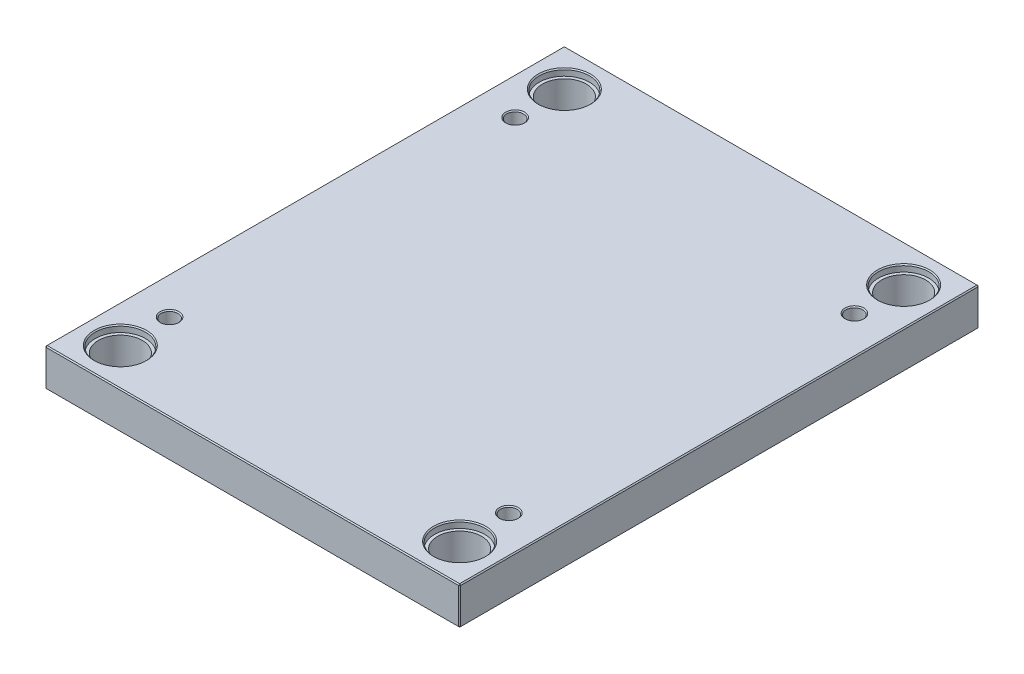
ISO-10303-21;
HEADER;
FILE_DESCRIPTION(('STEP AP214'),'2;1');
FILE_NAME('part.step','',(''),(''),'','','');
FILE_SCHEMA(('AUTOMOTIVE_DESIGN { 1 0 10303 214 1 1 1 1 }'));
ENDSEC;
DATA;
#1=APPLICATION_CONTEXT('core data for automotive mechanical design processes');
#2=APPLICATION_PROTOCOL_DEFINITION('international standard','automotive_design',2000,#1);
#3=PRODUCT_CONTEXT('',#1,'mechanical');
#4=PRODUCT('Part','Part','',(#3));
#5=PRODUCT_RELATED_PRODUCT_CATEGORY('part','',(#4));
#6=PRODUCT_DEFINITION_FORMATION('','',#4);
#7=PRODUCT_DEFINITION_CONTEXT('part definition',#1,'design');
#8=PRODUCT_DEFINITION('design','',#6,#7);
#9=PRODUCT_DEFINITION_SHAPE('','',#8);
#10=(LENGTH_UNIT() NAMED_UNIT(*) SI_UNIT(.MILLI.,.METRE.));
#11=(NAMED_UNIT(*) PLANE_ANGLE_UNIT() SI_UNIT($,.RADIAN.));
#12=(NAMED_UNIT(*) SI_UNIT($,.STERADIAN.) SOLID_ANGLE_UNIT());
#13=UNCERTAINTY_MEASURE_WITH_UNIT(LENGTH_MEASURE(1.E-05),#10,'distance_accuracy_value','');
#14=(GEOMETRIC_REPRESENTATION_CONTEXT(3) GLOBAL_UNCERTAINTY_ASSIGNED_CONTEXT((#13)) GLOBAL_UNIT_ASSIGNED_CONTEXT((#10,
#11,#12)) REPRESENTATION_CONTEXT('',''));
#15=CARTESIAN_POINT('',(0.,0.,0.));
#16=DIRECTION('',(0.,0.,1.));
#17=DIRECTION('',(1.,0.,0.));
#18=AXIS2_PLACEMENT_3D('',#15,#16,#17);
#19=CARTESIAN_POINT('',(-162.,0.,-212.));
#20=DIRECTION('',(0.,1.,0.));
#21=DIRECTION('',(0.,0.,1.));
#22=AXIS2_PLACEMENT_3D('',#19,#20,#21);
#23=CYLINDRICAL_SURFACE('',#22,21.);
#24=CARTESIAN_POINT('',(-162.,1.00000000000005,-212.));
#25=DIRECTION('',(0.,1.,0.));
#26=DIRECTION('',(0.,0.,1.));
#27=AXIS2_PLACEMENT_3D('',#24,#25,#26);
#28=CIRCLE('',#27,21.);
#29=CARTESIAN_POINT('',(-162.,1.00000000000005,-191.));
#30=VERTEX_POINT('',#29);
#31=EDGE_CURVE('E472',#30,#30,#28,.F.);
#32=ORIENTED_EDGE('',*,*,#31,.T.);
#33=EDGE_LOOP('',(#32));
#34=FACE_BOUND('',#33,.T.);
#35=CARTESIAN_POINT('',(-162.,29.7,-212.));
#36=DIRECTION('',(0.,1.,0.));
#37=DIRECTION('',(0.,0.,1.));
#38=AXIS2_PLACEMENT_3D('',#35,#36,#37);
#39=CIRCLE('',#38,21.);
#40=CARTESIAN_POINT('',(-162.,29.7,-191.));
#41=VERTEX_POINT('',#40);
#42=EDGE_CURVE('E221',#41,#41,#39,.F.);
#43=ORIENTED_EDGE('',*,*,#42,.F.);
#44=EDGE_LOOP('',(#43));
#45=FACE_BOUND('',#44,.T.);
#46=ADVANCED_FACE('F16',(#34,#45),#23,.F.);
#47=CARTESIAN_POINT('',(162.,0.,-212.));
#48=DIRECTION('',(0.,1.,0.));
#49=DIRECTION('',(0.,0.,1.));
#50=AXIS2_PLACEMENT_3D('',#47,#48,#49);
#51=CYLINDRICAL_SURFACE('',#50,21.);
#52=CARTESIAN_POINT('',(162.,1.00000000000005,-212.));
#53=DIRECTION('',(0.,1.,0.));
#54=DIRECTION('',(0.,0.,1.));
#55=AXIS2_PLACEMENT_3D('',#52,#53,#54);
#56=CIRCLE('',#55,21.);
#57=CARTESIAN_POINT('',(162.,1.00000000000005,-191.));
#58=VERTEX_POINT('',#57);
#59=EDGE_CURVE('E474',#58,#58,#56,.F.);
#60=ORIENTED_EDGE('',*,*,#59,.T.);
#61=EDGE_LOOP('',(#60));
#62=FACE_BOUND('',#61,.T.);
#63=CARTESIAN_POINT('',(162.,29.7,-212.));
#64=DIRECTION('',(0.,1.,0.));
#65=DIRECTION('',(0.,0.,1.));
#66=AXIS2_PLACEMENT_3D('',#63,#64,#65);
#67=CIRCLE('',#66,21.);
#68=CARTESIAN_POINT('',(162.,29.7,-191.));
#69=VERTEX_POINT('',#68);
#70=EDGE_CURVE('E218',#69,#69,#67,.F.);
#71=ORIENTED_EDGE('',*,*,#70,.F.);
#72=EDGE_LOOP('',(#71));
#73=FACE_BOUND('',#72,.T.);
#74=ADVANCED_FACE('F263',(#62,#73),#51,.F.);
#75=CARTESIAN_POINT('',(162.,0.,212.));
#76=DIRECTION('',(0.,1.,0.));
#77=DIRECTION('',(0.,0.,1.));
#78=AXIS2_PLACEMENT_3D('',#75,#76,#77);
#79=CYLINDRICAL_SURFACE('',#78,21.);
#80=CARTESIAN_POINT('',(162.,1.00000000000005,212.));
#81=DIRECTION('',(0.,1.,0.));
#82=DIRECTION('',(0.,0.,1.));
#83=AXIS2_PLACEMENT_3D('',#80,#81,#82);
#84=CIRCLE('',#83,21.);
#85=CARTESIAN_POINT('',(162.,1.00000000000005,233.));
#86=VERTEX_POINT('',#85);
#87=EDGE_CURVE('E477',#86,#86,#84,.F.);
#88=ORIENTED_EDGE('',*,*,#87,.T.);
#89=EDGE_LOOP('',(#88));
#90=FACE_BOUND('',#89,.T.);
#91=CARTESIAN_POINT('',(162.,29.7,212.));
#92=DIRECTION('',(0.,1.,0.));
#93=DIRECTION('',(0.,0.,1.));
#94=AXIS2_PLACEMENT_3D('',#91,#92,#93);
#95=CIRCLE('',#94,21.);
#96=CARTESIAN_POINT('',(162.,29.7,233.));
#97=VERTEX_POINT('',#96);
#98=EDGE_CURVE('E214',#97,#97,#95,.F.);
#99=ORIENTED_EDGE('',*,*,#98,.F.);
#100=EDGE_LOOP('',(#99));
#101=FACE_BOUND('',#100,.T.);
#102=ADVANCED_FACE('F270',(#90,#101),#79,.F.);
#103=CARTESIAN_POINT('',(-162.,0.,212.));
#104=DIRECTION('',(0.,1.,0.));
#105=DIRECTION('',(0.,0.,1.));
#106=AXIS2_PLACEMENT_3D('',#103,#104,#105);
#107=CYLINDRICAL_SURFACE('',#106,21.);
#108=CARTESIAN_POINT('',(-162.,1.00000000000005,212.));
#109=DIRECTION('',(0.,1.,0.));
#110=DIRECTION('',(0.,0.,1.));
#111=AXIS2_PLACEMENT_3D('',#108,#109,#110);
#112=CIRCLE('',#111,21.);
#113=CARTESIAN_POINT('',(-162.,1.00000000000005,233.));
#114=VERTEX_POINT('',#113);
#115=EDGE_CURVE('E480',#114,#114,#112,.F.);
#116=ORIENTED_EDGE('',*,*,#115,.T.);
#117=EDGE_LOOP('',(#116));
#118=FACE_BOUND('',#117,.T.);
#119=CARTESIAN_POINT('',(-162.,29.7,212.));
#120=DIRECTION('',(0.,1.,0.));
#121=DIRECTION('',(0.,0.,1.));
#122=AXIS2_PLACEMENT_3D('',#119,#120,#121);
#123=CIRCLE('',#122,21.);
#124=CARTESIAN_POINT('',(-162.,29.7,233.));
#125=VERTEX_POINT('',#124);
#126=EDGE_CURVE('E211',#125,#125,#123,.F.);
#127=ORIENTED_EDGE('',*,*,#126,.F.);
#128=EDGE_LOOP('',(#127));
#129=FACE_BOUND('',#128,.T.);
#130=ADVANCED_FACE('F277',(#118,#129),#107,.F.);
#131=CARTESIAN_POINT('',(-198.,36.,248.));
#132=DIRECTION('',(1.,0.,0.));
#133=DIRECTION('',(0.,0.,-1.));
#134=AXIS2_PLACEMENT_3D('',#131,#132,#133);
#135=PLANE('',#134);
#136=DIRECTION('',(0.,-1.,0.));
#137=VECTOR('',#136,1.);
#138=CARTESIAN_POINT('',(-198.,36.,-247.));
#139=LINE('',#138,#137);
#140=CARTESIAN_POINT('',(-198.,35.,-247.));
#141=VERTEX_POINT('',#140);
#142=CARTESIAN_POINT('',(-198.,1.00000000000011,-247.));
#143=VERTEX_POINT('',#142);
#144=EDGE_CURVE('E487',#141,#143,#139,.T.);
#145=ORIENTED_EDGE('',*,*,#144,.T.);
#146=DIRECTION('',(0.,0.,1.));
#147=VECTOR('',#146,1.);
#148=CARTESIAN_POINT('',(-198.,1.00000000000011,248.));
#149=LINE('',#148,#147);
#150=CARTESIAN_POINT('',(-198.,1.00000000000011,247.));
#151=VERTEX_POINT('',#150);
#152=EDGE_CURVE('E490',#143,#151,#149,.T.);
#153=ORIENTED_EDGE('',*,*,#152,.T.);
#154=DIRECTION('',(0.,1.,0.));
#155=VECTOR('',#154,1.);
#156=CARTESIAN_POINT('',(-198.,36.,247.));
#157=LINE('',#156,#155);
#158=CARTESIAN_POINT('',(-198.,35.,247.));
#159=VERTEX_POINT('',#158);
#160=EDGE_CURVE('E485',#151,#159,#157,.T.);
#161=ORIENTED_EDGE('',*,*,#160,.T.);
#162=DIRECTION('',(0.,0.,-1.));
#163=VECTOR('',#162,1.);
#164=CARTESIAN_POINT('',(-198.,35.,-248.));
#165=LINE('',#164,#163);
#166=EDGE_CURVE('E483',#159,#141,#165,.T.);
#167=ORIENTED_EDGE('',*,*,#166,.T.);
#168=EDGE_LOOP('',(#145,#153,#161,#167));
#169=FACE_BOUND('',#168,.T.);
#170=ADVANCED_FACE('F298',(#169),#135,.F.);
#171=CARTESIAN_POINT('',(198.,36.,248.));
#172=DIRECTION('',(0.,0.,-1.));
#173=DIRECTION('',(-1.,0.,0.));
#174=AXIS2_PLACEMENT_3D('',#171,#172,#173);
#175=PLANE('',#174);
#176=DIRECTION('',(-1.,0.,0.));
#177=VECTOR('',#176,1.);
#178=CARTESIAN_POINT('',(-198.,35.,248.));
#179=LINE('',#178,#177);
#180=CARTESIAN_POINT('',(197.,35.,248.));
#181=VERTEX_POINT('',#180);
#182=CARTESIAN_POINT('',(-197.,35.,248.));
#183=VERTEX_POINT('',#182);
#184=EDGE_CURVE('E509',#181,#183,#179,.T.);
#185=ORIENTED_EDGE('',*,*,#184,.T.);
#186=DIRECTION('',(0.,-1.,0.));
#187=VECTOR('',#186,1.);
#188=CARTESIAN_POINT('',(-197.,36.,248.));
#189=LINE('',#188,#187);
#190=CARTESIAN_POINT('',(-197.,1.00000000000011,248.));
#191=VERTEX_POINT('',#190);
#192=EDGE_CURVE('E515',#183,#191,#189,.T.);
#193=ORIENTED_EDGE('',*,*,#192,.T.);
#194=DIRECTION('',(1.,0.,0.));
#195=VECTOR('',#194,1.);
#196=CARTESIAN_POINT('',(198.,1.00000000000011,248.));
#197=LINE('',#196,#195);
#198=CARTESIAN_POINT('',(197.,1.00000000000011,248.));
#199=VERTEX_POINT('',#198);
#200=EDGE_CURVE('E513',#191,#199,#197,.T.);
#201=ORIENTED_EDGE('',*,*,#200,.T.);
#202=DIRECTION('',(0.,1.,0.));
#203=VECTOR('',#202,1.);
#204=CARTESIAN_POINT('',(197.,36.,248.));
#205=LINE('',#204,#203);
#206=EDGE_CURVE('E511',#199,#181,#205,.T.);
#207=ORIENTED_EDGE('',*,*,#206,.T.);
#208=EDGE_LOOP('',(#185,#193,#201,#207));
#209=FACE_BOUND('',#208,.T.);
#210=ADVANCED_FACE('F294',(#209),#175,.F.);
#211=CARTESIAN_POINT('',(198.,36.,248.));
#212=DIRECTION('',(-1.,0.,0.));
#213=DIRECTION('',(0.,0.,1.));
#214=AXIS2_PLACEMENT_3D('',#211,#212,#213);
#215=PLANE('',#214);
#216=DIRECTION('',(0.,0.,-1.));
#217=VECTOR('',#216,1.);
#218=CARTESIAN_POINT('',(198.,1.00000000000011,248.));
#219=LINE('',#218,#217);
#220=CARTESIAN_POINT('',(198.,1.00000000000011,247.));
#221=VERTEX_POINT('',#220);
#222=CARTESIAN_POINT('',(198.,1.00000000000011,-247.));
#223=VERTEX_POINT('',#222);
#224=EDGE_CURVE('E504',#221,#223,#219,.T.);
#225=ORIENTED_EDGE('',*,*,#224,.T.);
#226=DIRECTION('',(0.,1.,0.));
#227=VECTOR('',#226,1.);
#228=CARTESIAN_POINT('',(198.,36.,-247.));
#229=LINE('',#228,#227);
#230=CARTESIAN_POINT('',(198.,35.,-247.));
#231=VERTEX_POINT('',#230);
#232=EDGE_CURVE('E506',#223,#231,#229,.T.);
#233=ORIENTED_EDGE('',*,*,#232,.T.);
#234=DIRECTION('',(0.,0.,1.));
#235=VECTOR('',#234,1.);
#236=CARTESIAN_POINT('',(198.,35.,248.));
#237=LINE('',#236,#235);
#238=CARTESIAN_POINT('',(198.,35.,247.));
#239=VERTEX_POINT('',#238);
#240=EDGE_CURVE('E500',#231,#239,#237,.T.);
#241=ORIENTED_EDGE('',*,*,#240,.T.);
#242=DIRECTION('',(0.,-1.,0.));
#243=VECTOR('',#242,1.);
#244=CARTESIAN_POINT('',(198.,36.,247.));
#245=LINE('',#244,#243);
#246=EDGE_CURVE('E502',#239,#221,#245,.T.);
#247=ORIENTED_EDGE('',*,*,#246,.T.);
#248=EDGE_LOOP('',(#225,#233,#241,#247));
#249=FACE_BOUND('',#248,.T.);
#250=ADVANCED_FACE('F290',(#249),#215,.F.);
#251=CARTESIAN_POINT('',(198.,36.,-248.));
#252=DIRECTION('',(0.,0.,1.));
#253=DIRECTION('',(1.,0.,0.));
#254=AXIS2_PLACEMENT_3D('',#251,#252,#253);
#255=PLANE('',#254);
#256=DIRECTION('',(0.,-1.,0.));
#257=VECTOR('',#256,1.);
#258=CARTESIAN_POINT('',(197.,36.,-248.));
#259=LINE('',#258,#257);
#260=CARTESIAN_POINT('',(197.,35.,-248.));
#261=VERTEX_POINT('',#260);
#262=CARTESIAN_POINT('',(197.,1.00000000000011,-248.));
#263=VERTEX_POINT('',#262);
#264=EDGE_CURVE('E494',#261,#263,#259,.T.);
#265=ORIENTED_EDGE('',*,*,#264,.T.);
#266=DIRECTION('',(-1.,0.,0.));
#267=VECTOR('',#266,1.);
#268=CARTESIAN_POINT('',(198.,1.00000000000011,-248.));
#269=LINE('',#268,#267);
#270=CARTESIAN_POINT('',(-197.,1.00000000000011,-248.));
#271=VERTEX_POINT('',#270);
#272=EDGE_CURVE('E138',#263,#271,#269,.T.);
#273=ORIENTED_EDGE('',*,*,#272,.T.);
#274=DIRECTION('',(0.,1.,0.));
#275=VECTOR('',#274,1.);
#276=CARTESIAN_POINT('',(-197.,36.,-248.));
#277=LINE('',#276,#275);
#278=CARTESIAN_POINT('',(-197.,35.,-248.));
#279=VERTEX_POINT('',#278);
#280=EDGE_CURVE('E496',#271,#279,#277,.T.);
#281=ORIENTED_EDGE('',*,*,#280,.T.);
#282=DIRECTION('',(1.,0.,0.));
#283=VECTOR('',#282,1.);
#284=CARTESIAN_POINT('',(198.,35.,-248.));
#285=LINE('',#284,#283);
#286=EDGE_CURVE('E492',#279,#261,#285,.T.);
#287=ORIENTED_EDGE('',*,*,#286,.T.);
#288=EDGE_LOOP('',(#265,#273,#281,#287));
#289=FACE_BOUND('',#288,.T.);
#290=ADVANCED_FACE('F282',(#289),#255,.F.);
#291=CARTESIAN_POINT('',(0.,36.,0.));
#292=DIRECTION('',(0.,1.,0.));
#293=DIRECTION('',(0.,0.,1.));
#294=AXIS2_PLACEMENT_3D('',#291,#292,#293);
#295=PLANE('',#294);
#296=CARTESIAN_POINT('',(162.,36.,212.));
#297=DIRECTION('',(0.,1.,0.));
#298=DIRECTION('',(0.,0.,1.));
#299=AXIS2_PLACEMENT_3D('',#296,#297,#298);
#300=CIRCLE('',#299,25.);
#301=CARTESIAN_POINT('',(162.,36.,237.));
#302=VERTEX_POINT('',#301);
#303=EDGE_CURVE('E236',#302,#302,#300,.F.);
#304=ORIENTED_EDGE('',*,*,#303,.T.);
#305=EDGE_LOOP('',(#304));
#306=FACE_BOUND('',#305,.T.);
#307=CARTESIAN_POINT('',(-162.,36.,212.));
#308=DIRECTION('',(0.,1.,0.));
#309=DIRECTION('',(0.,0.,1.));
#310=AXIS2_PLACEMENT_3D('',#307,#308,#309);
#311=CIRCLE('',#310,25.);
#312=CARTESIAN_POINT('',(-162.,36.,237.));
#313=VERTEX_POINT('',#312);
#314=EDGE_CURVE('E233',#313,#313,#311,.F.);
#315=ORIENTED_EDGE('',*,*,#314,.T.);
#316=EDGE_LOOP('',(#315));
#317=FACE_BOUND('',#316,.T.);
#318=CARTESIAN_POINT('',(162.,36.,-212.));
#319=DIRECTION('',(0.,1.,0.));
#320=DIRECTION('',(0.,0.,1.));
#321=AXIS2_PLACEMENT_3D('',#318,#319,#320);
#322=CIRCLE('',#321,25.);
#323=CARTESIAN_POINT('',(162.,36.,-187.));
#324=VERTEX_POINT('',#323);
#325=EDGE_CURVE('E230',#324,#324,#322,.F.);
#326=ORIENTED_EDGE('',*,*,#325,.T.);
#327=EDGE_LOOP('',(#326));
#328=FACE_BOUND('',#327,.T.);
#329=CARTESIAN_POINT('',(-162.,36.,-212.));
#330=DIRECTION('',(0.,1.,0.));
#331=DIRECTION('',(0.,0.,1.));
#332=AXIS2_PLACEMENT_3D('',#329,#330,#331);
#333=CIRCLE('',#332,25.);
#334=CARTESIAN_POINT('',(-162.,36.,-187.));
#335=VERTEX_POINT('',#334);
#336=EDGE_CURVE('E227',#335,#335,#333,.F.);
#337=ORIENTED_EDGE('',*,*,#336,.T.);
#338=EDGE_LOOP('',(#337));
#339=FACE_BOUND('',#338,.T.);
#340=CARTESIAN_POINT('',(-162.,36.,165.));
#341=DIRECTION('',(0.,1.,0.));
#342=DIRECTION('',(0.,0.,1.));
#343=AXIS2_PLACEMENT_3D('',#340,#341,#342);
#344=CIRCLE('',#343,9.00000000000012);
#345=CARTESIAN_POINT('',(-162.,36.,174.));
#346=VERTEX_POINT('',#345);
#347=EDGE_CURVE('E198',#346,#346,#344,.F.);
#348=ORIENTED_EDGE('',*,*,#347,.T.);
#349=EDGE_LOOP('',(#348));
#350=FACE_BOUND('',#349,.T.);
#351=CARTESIAN_POINT('',(162.,36.,165.));
#352=DIRECTION('',(0.,1.,0.));
#353=DIRECTION('',(0.,0.,1.));
#354=AXIS2_PLACEMENT_3D('',#351,#352,#353);
#355=CIRCLE('',#354,9.00000000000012);
#356=CARTESIAN_POINT('',(162.,36.,174.));
#357=VERTEX_POINT('',#356);
#358=EDGE_CURVE('E195',#357,#357,#355,.F.);
#359=ORIENTED_EDGE('',*,*,#358,.T.);
#360=EDGE_LOOP('',(#359));
#361=FACE_BOUND('',#360,.T.);
#362=CARTESIAN_POINT('',(162.,36.,-165.));
#363=DIRECTION('',(0.,1.,0.));
#364=DIRECTION('',(0.,0.,1.));
#365=AXIS2_PLACEMENT_3D('',#362,#363,#364);
#366=CIRCLE('',#365,9.00000000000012);
#367=CARTESIAN_POINT('',(162.,36.,-156.));
#368=VERTEX_POINT('',#367);
#369=EDGE_CURVE('E192',#368,#368,#366,.F.);
#370=ORIENTED_EDGE('',*,*,#369,.T.);
#371=EDGE_LOOP('',(#370));
#372=FACE_BOUND('',#371,.T.);
#373=CARTESIAN_POINT('',(-162.,36.,-165.));
#374=DIRECTION('',(0.,1.,0.));
#375=DIRECTION('',(0.,0.,1.));
#376=AXIS2_PLACEMENT_3D('',#373,#374,#375);
#377=CIRCLE('',#376,9.00000000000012);
#378=CARTESIAN_POINT('',(-162.,36.,-156.));
#379=VERTEX_POINT('',#378);
#380=EDGE_CURVE('E188',#379,#379,#377,.F.);
#381=ORIENTED_EDGE('',*,*,#380,.T.);
#382=EDGE_LOOP('',(#381));
#383=FACE_BOUND('',#382,.T.);
#384=DIRECTION('',(0.,0.,-1.));
#385=VECTOR('',#384,1.);
#386=CARTESIAN_POINT('',(197.,36.,-248.));
#387=LINE('',#386,#385);
#388=CARTESIAN_POINT('',(197.,36.,247.));
#389=VERTEX_POINT('',#388);
#390=CARTESIAN_POINT('',(197.,36.,-247.));
#391=VERTEX_POINT('',#390);
#392=EDGE_CURVE('E31',#389,#391,#387,.T.);
#393=ORIENTED_EDGE('',*,*,#392,.T.);
#394=DIRECTION('',(-1.,0.,0.));
#395=VECTOR('',#394,1.);
#396=CARTESIAN_POINT('',(-198.,36.,-247.));
#397=LINE('',#396,#395);
#398=CARTESIAN_POINT('',(-197.,36.,-247.));
#399=VERTEX_POINT('',#398);
#400=EDGE_CURVE('E189',#391,#399,#397,.T.);
#401=ORIENTED_EDGE('',*,*,#400,.T.);
#402=DIRECTION('',(0.,0.,1.));
#403=VECTOR('',#402,1.);
#404=CARTESIAN_POINT('',(-197.,36.,248.));
#405=LINE('',#404,#403);
#406=CARTESIAN_POINT('',(-197.,36.,247.));
#407=VERTEX_POINT('',#406);
#408=EDGE_CURVE('E518',#399,#407,#405,.T.);
#409=ORIENTED_EDGE('',*,*,#408,.T.);
#410=DIRECTION('',(1.,0.,0.));
#411=VECTOR('',#410,1.);
#412=CARTESIAN_POINT('',(198.,36.,247.));
#413=LINE('',#412,#411);
#414=EDGE_CURVE('E36',#407,#389,#413,.T.);
#415=ORIENTED_EDGE('',*,*,#414,.T.);
#416=EDGE_LOOP('',(#393,#401,#409,#415));
#417=FACE_BOUND('',#416,.T.);
#418=ADVANCED_FACE('F279',(#306,#317,#328,#339,#350,#361,#372,#383,#417),#295,.T.);
#419=CARTESIAN_POINT('',(0.,0.,0.));
#420=DIRECTION('',(0.,1.,0.));
#421=DIRECTION('',(0.,0.,1.));
#422=AXIS2_PLACEMENT_3D('',#419,#420,#421);
#423=PLANE('',#422);
#424=CARTESIAN_POINT('',(-162.,0.,-212.));
#425=DIRECTION('',(0.,1.,0.));
#426=DIRECTION('',(0.,0.,1.));
#427=AXIS2_PLACEMENT_3D('',#424,#425,#426);
#428=CIRCLE('',#427,22.);
#429=CARTESIAN_POINT('',(-162.,0.,-190.));
#430=VERTEX_POINT('',#429);
#431=EDGE_CURVE('E469',#430,#430,#428,.T.);
#432=ORIENTED_EDGE('',*,*,#431,.T.);
#433=EDGE_LOOP('',(#432));
#434=FACE_BOUND('',#433,.T.);
#435=CARTESIAN_POINT('',(162.,0.,-212.));
#436=DIRECTION('',(0.,1.,0.));
#437=DIRECTION('',(0.,0.,1.));
#438=AXIS2_PLACEMENT_3D('',#435,#436,#437);
#439=CIRCLE('',#438,22.);
#440=CARTESIAN_POINT('',(162.,0.,-190.));
#441=VERTEX_POINT('',#440);
#442=EDGE_CURVE('E466',#441,#441,#439,.T.);
#443=ORIENTED_EDGE('',*,*,#442,.T.);
#444=EDGE_LOOP('',(#443));
#445=FACE_BOUND('',#444,.T.);
#446=CARTESIAN_POINT('',(162.,0.,212.));
#447=DIRECTION('',(0.,1.,0.));
#448=DIRECTION('',(0.,0.,1.));
#449=AXIS2_PLACEMENT_3D('',#446,#447,#448);
#450=CIRCLE('',#449,22.);
#451=CARTESIAN_POINT('',(162.,0.,234.));
#452=VERTEX_POINT('',#451);
#453=EDGE_CURVE('E463',#452,#452,#450,.T.);
#454=ORIENTED_EDGE('',*,*,#453,.T.);
#455=EDGE_LOOP('',(#454));
#456=FACE_BOUND('',#455,.T.);
#457=CARTESIAN_POINT('',(-162.,0.,212.));
#458=DIRECTION('',(0.,1.,0.));
#459=DIRECTION('',(0.,0.,1.));
#460=AXIS2_PLACEMENT_3D('',#457,#458,#459);
#461=CIRCLE('',#460,22.);
#462=CARTESIAN_POINT('',(-162.,0.,234.));
#463=VERTEX_POINT('',#462);
#464=EDGE_CURVE('E460',#463,#463,#461,.T.);
#465=ORIENTED_EDGE('',*,*,#464,.T.);
#466=EDGE_LOOP('',(#465));
#467=FACE_BOUND('',#466,.T.);
#468=DIRECTION('',(0.,0.,1.));
#469=VECTOR('',#468,1.);
#470=CARTESIAN_POINT('',(197.,0.,0.));
#471=LINE('',#470,#469);
#472=CARTESIAN_POINT('',(197.,0.,-247.));
#473=VERTEX_POINT('',#472);
#474=CARTESIAN_POINT('',(197.,0.,247.));
#475=VERTEX_POINT('',#474);
#476=EDGE_CURVE('E108',#473,#475,#471,.T.);
#477=ORIENTED_EDGE('',*,*,#476,.T.);
#478=DIRECTION('',(-1.,0.,0.));
#479=VECTOR('',#478,1.);
#480=CARTESIAN_POINT('',(0.,0.,247.));
#481=LINE('',#480,#479);
#482=CARTESIAN_POINT('',(-197.,0.,247.));
#483=VERTEX_POINT('',#482);
#484=EDGE_CURVE('E458',#475,#483,#481,.T.);
#485=ORIENTED_EDGE('',*,*,#484,.T.);
#486=DIRECTION('',(0.,0.,-1.));
#487=VECTOR('',#486,1.);
#488=CARTESIAN_POINT('',(-197.,0.,0.));
#489=LINE('',#488,#487);
#490=CARTESIAN_POINT('',(-197.,0.,-247.));
#491=VERTEX_POINT('',#490);
#492=EDGE_CURVE('E110',#483,#491,#489,.T.);
#493=ORIENTED_EDGE('',*,*,#492,.T.);
#494=DIRECTION('',(1.,0.,0.));
#495=VECTOR('',#494,1.);
#496=CARTESIAN_POINT('',(0.,0.,-247.));
#497=LINE('',#496,#495);
#498=EDGE_CURVE('E104',#491,#473,#497,.T.);
#499=ORIENTED_EDGE('',*,*,#498,.T.);
#500=EDGE_LOOP('',(#477,#485,#493,#499));
#501=FACE_BOUND('',#500,.T.);
#502=ADVANCED_FACE('F106',(#434,#445,#456,#467,#501),#423,.F.);
#503=CARTESIAN_POINT('',(-162.,0.,-212.));
#504=DIRECTION('',(0.,-1.,0.));
#505=DIRECTION('',(0.,0.,-1.));
#506=AXIS2_PLACEMENT_3D('',#503,#504,#505);
#507=CONICAL_SURFACE('',#506,22.,0.785398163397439);
#508=ORIENTED_EDGE('',*,*,#31,.F.);
#509=EDGE_LOOP('',(#508));
#510=FACE_BOUND('',#509,.T.);
#511=ORIENTED_EDGE('',*,*,#431,.F.);
#512=EDGE_LOOP('',(#511));
#513=FACE_BOUND('',#512,.T.);
#514=ADVANCED_FACE('F286',(#510,#513),#507,.F.);
#515=CARTESIAN_POINT('',(162.,0.,-212.));
#516=DIRECTION('',(0.,-1.,0.));
#517=DIRECTION('',(0.,0.,-1.));
#518=AXIS2_PLACEMENT_3D('',#515,#516,#517);
#519=CONICAL_SURFACE('',#518,22.,0.785398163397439);
#520=ORIENTED_EDGE('',*,*,#59,.F.);
#521=EDGE_LOOP('',(#520));
#522=FACE_BOUND('',#521,.T.);
#523=ORIENTED_EDGE('',*,*,#442,.F.);
#524=EDGE_LOOP('',(#523));
#525=FACE_BOUND('',#524,.T.);
#526=ADVANCED_FACE('F305',(#522,#525),#519,.F.);
#527=CARTESIAN_POINT('',(162.,0.,212.));
#528=DIRECTION('',(0.,-1.,0.));
#529=DIRECTION('',(0.,0.,-1.));
#530=AXIS2_PLACEMENT_3D('',#527,#528,#529);
#531=CONICAL_SURFACE('',#530,22.,0.785398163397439);
#532=ORIENTED_EDGE('',*,*,#87,.F.);
#533=EDGE_LOOP('',(#532));
#534=FACE_BOUND('',#533,.T.);
#535=ORIENTED_EDGE('',*,*,#453,.F.);
#536=EDGE_LOOP('',(#535));
#537=FACE_BOUND('',#536,.T.);
#538=ADVANCED_FACE('F309',(#534,#537),#531,.F.);
#539=CARTESIAN_POINT('',(-162.,0.,212.));
#540=DIRECTION('',(0.,-1.,0.));
#541=DIRECTION('',(0.,0.,-1.));
#542=AXIS2_PLACEMENT_3D('',#539,#540,#541);
#543=CONICAL_SURFACE('',#542,22.,0.785398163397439);
#544=ORIENTED_EDGE('',*,*,#115,.F.);
#545=EDGE_LOOP('',(#544));
#546=FACE_BOUND('',#545,.T.);
#547=ORIENTED_EDGE('',*,*,#464,.F.);
#548=EDGE_LOOP('',(#547));
#549=FACE_BOUND('',#548,.T.);
#550=ADVANCED_FACE('F313',(#546,#549),#543,.F.);
#551=CARTESIAN_POINT('',(198.,36.,247.));
#552=DIRECTION('',(-0.707106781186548,0.,-0.707106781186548));
#553=DIRECTION('',(0.,-1.,0.));
#554=AXIS2_PLACEMENT_3D('',#551,#552,#553);
#555=PLANE('',#554);
#556=DIRECTION('',(-0.707106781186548,0.,0.707106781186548));
#557=VECTOR('',#556,1.);
#558=CARTESIAN_POINT('',(197.,35.,248.));
#559=LINE('',#558,#557);
#560=EDGE_CURVE('E126',#181,#239,#559,.F.);
#561=ORIENTED_EDGE('',*,*,#560,.F.);
#562=ORIENTED_EDGE('',*,*,#206,.F.);
#563=DIRECTION('',(0.707106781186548,0.,-0.707106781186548));
#564=VECTOR('',#563,1.);
#565=CARTESIAN_POINT('',(197.,1.00000000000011,248.));
#566=LINE('',#565,#564);
#567=EDGE_CURVE('E180',#221,#199,#566,.F.);
#568=ORIENTED_EDGE('',*,*,#567,.F.);
#569=ORIENTED_EDGE('',*,*,#246,.F.);
#570=EDGE_LOOP('',(#561,#562,#568,#569));
#571=FACE_BOUND('',#570,.T.);
#572=ADVANCED_FACE('F317',(#571),#555,.F.);
#573=CARTESIAN_POINT('',(197.,35.,248.));
#574=DIRECTION('',(0.577350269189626,0.577350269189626,0.577350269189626));
#575=DIRECTION('',(0.707106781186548,0.,-0.707106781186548));
#576=AXIS2_PLACEMENT_3D('',#573,#574,#575);
#577=PLANE('',#576);
#578=DIRECTION('',(0.,-0.707106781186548,0.707106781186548));
#579=VECTOR('',#578,1.);
#580=CARTESIAN_POINT('',(197.,35.,248.));
#581=LINE('',#580,#579);
#582=EDGE_CURVE('E175',#181,#389,#581,.F.);
#583=ORIENTED_EDGE('',*,*,#582,.F.);
#584=ORIENTED_EDGE('',*,*,#560,.T.);
#585=DIRECTION('',(-0.707106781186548,0.707106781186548,0.));
#586=VECTOR('',#585,1.);
#587=CARTESIAN_POINT('',(197.5,35.5,247.));
#588=LINE('',#587,#586);
#589=EDGE_CURVE('E177',#389,#239,#588,.F.);
#590=ORIENTED_EDGE('',*,*,#589,.F.);
#591=EDGE_LOOP('',(#583,#584,#590));
#592=FACE_BOUND('',#591,.T.);
#593=ADVANCED_FACE('F385',(#592),#577,.T.);
#594=CARTESIAN_POINT('',(197.,1.00000000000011,248.));
#595=DIRECTION('',(0.577350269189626,-0.577350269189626,0.577350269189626));
#596=DIRECTION('',(0.707106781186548,0.,-0.707106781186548));
#597=AXIS2_PLACEMENT_3D('',#594,#595,#596);
#598=PLANE('',#597);
#599=DIRECTION('',(-0.707106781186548,-0.707106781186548,0.));
#600=VECTOR('',#599,1.);
#601=CARTESIAN_POINT('',(197.5,0.500000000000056,247.));
#602=LINE('',#601,#600);
#603=EDGE_CURVE('E124',#221,#475,#602,.T.);
#604=ORIENTED_EDGE('',*,*,#603,.F.);
#605=ORIENTED_EDGE('',*,*,#567,.T.);
#606=DIRECTION('',(0.,0.707106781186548,0.707106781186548));
#607=VECTOR('',#606,1.);
#608=CARTESIAN_POINT('',(197.,1.00000000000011,248.));
#609=LINE('',#608,#607);
#610=EDGE_CURVE('E172',#475,#199,#609,.T.);
#611=ORIENTED_EDGE('',*,*,#610,.F.);
#612=EDGE_LOOP('',(#604,#605,#611));
#613=FACE_BOUND('',#612,.T.);
#614=ADVANCED_FACE('F381',(#613),#598,.T.);
#615=CARTESIAN_POINT('',(197.,36.,0.));
#616=DIRECTION('',(0.707106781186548,0.707106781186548,0.));
#617=DIRECTION('',(0.,0.,1.));
#618=AXIS2_PLACEMENT_3D('',#615,#616,#617);
#619=PLANE('',#618);
#620=ORIENTED_EDGE('',*,*,#589,.T.);
#621=ORIENTED_EDGE('',*,*,#240,.F.);
#622=DIRECTION('',(0.707106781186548,-0.707106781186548,0.));
#623=VECTOR('',#622,1.);
#624=CARTESIAN_POINT('',(198.,35.,-247.));
#625=LINE('',#624,#623);
#626=EDGE_CURVE('E166',#391,#231,#625,.T.);
#627=ORIENTED_EDGE('',*,*,#626,.F.);
#628=ORIENTED_EDGE('',*,*,#392,.F.);
#629=EDGE_LOOP('',(#620,#621,#627,#628));
#630=FACE_BOUND('',#629,.T.);
#631=ADVANCED_FACE('F377',(#630),#619,.T.);
#632=CARTESIAN_POINT('',(0.,36.,247.));
#633=DIRECTION('',(0.,0.707106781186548,0.707106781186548));
#634=DIRECTION('',(-1.,0.,0.));
#635=AXIS2_PLACEMENT_3D('',#632,#633,#634);
#636=PLANE('',#635);
#637=ORIENTED_EDGE('',*,*,#582,.T.);
#638=ORIENTED_EDGE('',*,*,#414,.F.);
#639=DIRECTION('',(0.,0.707106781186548,-0.707106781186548));
#640=VECTOR('',#639,1.);
#641=CARTESIAN_POINT('',(-197.,35.5,247.5));
#642=LINE('',#641,#640);
#643=EDGE_CURVE('E163',#183,#407,#642,.T.);
#644=ORIENTED_EDGE('',*,*,#643,.F.);
#645=ORIENTED_EDGE('',*,*,#184,.F.);
#646=EDGE_LOOP('',(#637,#638,#644,#645));
#647=FACE_BOUND('',#646,.T.);
#648=ADVANCED_FACE('F373',(#647),#636,.T.);
#649=CARTESIAN_POINT('',(-197.,36.,248.));
#650=DIRECTION('',(0.707106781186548,0.,-0.707106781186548));
#651=DIRECTION('',(0.,-1.,0.));
#652=AXIS2_PLACEMENT_3D('',#649,#650,#651);
#653=PLANE('',#652);
#654=DIRECTION('',(0.707106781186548,0.,0.707106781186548));
#655=VECTOR('',#654,1.);
#656=CARTESIAN_POINT('',(-197.,1.00000000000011,248.));
#657=LINE('',#656,#655);
#658=EDGE_CURVE('E157',#191,#151,#657,.F.);
#659=ORIENTED_EDGE('',*,*,#658,.F.);
#660=ORIENTED_EDGE('',*,*,#192,.F.);
#661=DIRECTION('',(-0.707106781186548,0.,-0.707106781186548));
#662=VECTOR('',#661,1.);
#663=CARTESIAN_POINT('',(-198.,35.,247.));
#664=LINE('',#663,#662);
#665=EDGE_CURVE('E160',#159,#183,#664,.F.);
#666=ORIENTED_EDGE('',*,*,#665,.F.);
#667=ORIENTED_EDGE('',*,*,#160,.F.);
#668=EDGE_LOOP('',(#659,#660,#666,#667));
#669=FACE_BOUND('',#668,.T.);
#670=ADVANCED_FACE('F369',(#669),#653,.F.);
#671=CARTESIAN_POINT('',(198.,1.00000000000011,248.));
#672=DIRECTION('',(0.,0.707106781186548,-0.707106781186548));
#673=DIRECTION('',(1.,0.,0.));
#674=AXIS2_PLACEMENT_3D('',#671,#672,#673);
#675=PLANE('',#674);
#676=ORIENTED_EDGE('',*,*,#610,.T.);
#677=ORIENTED_EDGE('',*,*,#200,.F.);
#678=DIRECTION('',(0.,-0.707106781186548,-0.707106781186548));
#679=VECTOR('',#678,1.);
#680=CARTESIAN_POINT('',(-197.,1.00000000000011,248.));
#681=LINE('',#680,#679);
#682=EDGE_CURVE('E135',#483,#191,#681,.F.);
#683=ORIENTED_EDGE('',*,*,#682,.F.);
#684=ORIENTED_EDGE('',*,*,#484,.F.);
#685=EDGE_LOOP('',(#676,#677,#683,#684));
#686=FACE_BOUND('',#685,.T.);
#687=ADVANCED_FACE('F366',(#686),#675,.F.);
#688=CARTESIAN_POINT('',(198.,1.00000000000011,248.));
#689=DIRECTION('',(-0.707106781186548,0.707106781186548,0.));
#690=DIRECTION('',(0.,0.,-1.));
#691=AXIS2_PLACEMENT_3D('',#688,#689,#690);
#692=PLANE('',#691);
#693=ORIENTED_EDGE('',*,*,#603,.T.);
#694=ORIENTED_EDGE('',*,*,#476,.F.);
#695=DIRECTION('',(0.707106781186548,0.707106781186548,0.));
#696=VECTOR('',#695,1.);
#697=CARTESIAN_POINT('',(197.5,0.50000000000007,-247.));
#698=LINE('',#697,#696);
#699=EDGE_CURVE('E121',#223,#473,#698,.F.);
#700=ORIENTED_EDGE('',*,*,#699,.F.);
#701=ORIENTED_EDGE('',*,*,#224,.F.);
#702=EDGE_LOOP('',(#693,#694,#700,#701));
#703=FACE_BOUND('',#702,.T.);
#704=ADVANCED_FACE('F119',(#703),#692,.F.);
#705=CARTESIAN_POINT('',(197.,36.,-248.));
#706=DIRECTION('',(-0.707106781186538,0.,0.707106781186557));
#707=DIRECTION('',(0.,-1.,0.));
#708=AXIS2_PLACEMENT_3D('',#705,#706,#707);
#709=PLANE('',#708);
#710=DIRECTION('',(0.707106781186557,0.,0.707106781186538));
#711=VECTOR('',#710,1.);
#712=CARTESIAN_POINT('',(198.,35.,-247.));
#713=LINE('',#712,#711);
#714=EDGE_CURVE('E168',#231,#261,#713,.F.);
#715=ORIENTED_EDGE('',*,*,#714,.F.);
#716=ORIENTED_EDGE('',*,*,#232,.F.);
#717=DIRECTION('',(-0.707106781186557,0.,-0.707106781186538));
#718=VECTOR('',#717,1.);
#719=CARTESIAN_POINT('',(197.,1.00000000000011,-248.));
#720=LINE('',#719,#718);
#721=EDGE_CURVE('E134',#263,#223,#720,.F.);
#722=ORIENTED_EDGE('',*,*,#721,.F.);
#723=ORIENTED_EDGE('',*,*,#264,.F.);
#724=EDGE_LOOP('',(#715,#716,#722,#723));
#725=FACE_BOUND('',#724,.T.);
#726=ADVANCED_FACE('F359',(#725),#709,.F.);
#727=CARTESIAN_POINT('',(198.,35.,-247.));
#728=DIRECTION('',(0.577350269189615,0.577350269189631,-0.577350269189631));
#729=DIRECTION('',(0.,0.707106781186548,0.707106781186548));
#730=AXIS2_PLACEMENT_3D('',#727,#728,#729);
#731=PLANE('',#730);
#732=ORIENTED_EDGE('',*,*,#626,.T.);
#733=ORIENTED_EDGE('',*,*,#714,.T.);
#734=DIRECTION('',(0.,0.707106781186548,0.707106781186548));
#735=VECTOR('',#734,1.);
#736=CARTESIAN_POINT('',(197.,35.5,-247.5));
#737=LINE('',#736,#735);
#738=EDGE_CURVE('E152',#391,#261,#737,.F.);
#739=ORIENTED_EDGE('',*,*,#738,.F.);
#740=EDGE_LOOP('',(#732,#733,#739));
#741=FACE_BOUND('',#740,.T.);
#742=ADVANCED_FACE('F355',(#741),#731,.T.);
#743=CARTESIAN_POINT('',(-198.,35.,247.));
#744=DIRECTION('',(-0.577350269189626,0.577350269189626,0.577350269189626));
#745=DIRECTION('',(0.707106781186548,0.,0.707106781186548));
#746=AXIS2_PLACEMENT_3D('',#743,#744,#745);
#747=PLANE('',#746);
#748=ORIENTED_EDGE('',*,*,#665,.T.);
#749=ORIENTED_EDGE('',*,*,#643,.T.);
#750=DIRECTION('',(-0.707106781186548,-0.707106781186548,0.));
#751=VECTOR('',#750,1.);
#752=CARTESIAN_POINT('',(-198.,35.,247.));
#753=LINE('',#752,#751);
#754=EDGE_CURVE('E143',#159,#407,#753,.F.);
#755=ORIENTED_EDGE('',*,*,#754,.F.);
#756=EDGE_LOOP('',(#748,#749,#755));
#757=FACE_BOUND('',#756,.T.);
#758=ADVANCED_FACE('F351',(#757),#747,.T.);
#759=CARTESIAN_POINT('',(-197.,1.00000000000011,248.));
#760=DIRECTION('',(-0.577350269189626,-0.577350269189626,0.577350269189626));
#761=DIRECTION('',(0.707106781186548,0.,0.707106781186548));
#762=AXIS2_PLACEMENT_3D('',#759,#760,#761);
#763=PLANE('',#762);
#764=ORIENTED_EDGE('',*,*,#682,.T.);
#765=ORIENTED_EDGE('',*,*,#658,.T.);
#766=DIRECTION('',(-0.707106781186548,0.707106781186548,0.));
#767=VECTOR('',#766,1.);
#768=CARTESIAN_POINT('',(-197.5,0.500000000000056,247.));
#769=LINE('',#768,#767);
#770=EDGE_CURVE('E139',#483,#151,#769,.T.);
#771=ORIENTED_EDGE('',*,*,#770,.F.);
#772=EDGE_LOOP('',(#764,#765,#771));
#773=FACE_BOUND('',#772,.T.);
#774=ADVANCED_FACE('F348',(#773),#763,.T.);
#775=CARTESIAN_POINT('',(197.,1.00000000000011,-248.));
#776=DIRECTION('',(0.577350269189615,-0.577350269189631,-0.577350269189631));
#777=DIRECTION('',(0.,0.707106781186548,-0.707106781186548));
#778=AXIS2_PLACEMENT_3D('',#775,#776,#777);
#779=PLANE('',#778);
#780=ORIENTED_EDGE('',*,*,#721,.T.);
#781=ORIENTED_EDGE('',*,*,#699,.T.);
#782=DIRECTION('',(0.,-0.707106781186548,0.707106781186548));
#783=VECTOR('',#782,1.);
#784=CARTESIAN_POINT('',(197.,1.00000000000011,-248.));
#785=LINE('',#784,#783);
#786=EDGE_CURVE('E131',#263,#473,#785,.T.);
#787=ORIENTED_EDGE('',*,*,#786,.F.);
#788=EDGE_LOOP('',(#780,#781,#787));
#789=FACE_BOUND('',#788,.T.);
#790=ADVANCED_FACE('F130',(#789),#779,.T.);
#791=CARTESIAN_POINT('',(0.,36.,-247.));
#792=DIRECTION('',(0.,0.707106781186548,-0.707106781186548));
#793=DIRECTION('',(1.,0.,0.));
#794=AXIS2_PLACEMENT_3D('',#791,#792,#793);
#795=PLANE('',#794);
#796=ORIENTED_EDGE('',*,*,#738,.T.);
#797=ORIENTED_EDGE('',*,*,#286,.F.);
#798=DIRECTION('',(0.,-0.707106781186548,-0.707106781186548));
#799=VECTOR('',#798,1.);
#800=CARTESIAN_POINT('',(-197.,35.,-248.));
#801=LINE('',#800,#799);
#802=EDGE_CURVE('E140',#399,#279,#801,.T.);
#803=ORIENTED_EDGE('',*,*,#802,.F.);
#804=ORIENTED_EDGE('',*,*,#400,.F.);
#805=EDGE_LOOP('',(#796,#797,#803,#804));
#806=FACE_BOUND('',#805,.T.);
#807=ADVANCED_FACE('F341',(#806),#795,.T.);
#808=CARTESIAN_POINT('',(-197.,36.,0.));
#809=DIRECTION('',(-0.707106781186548,0.707106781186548,0.));
#810=DIRECTION('',(0.,0.,-1.));
#811=AXIS2_PLACEMENT_3D('',#808,#809,#810);
#812=PLANE('',#811);
#813=ORIENTED_EDGE('',*,*,#754,.T.);
#814=ORIENTED_EDGE('',*,*,#408,.F.);
#815=DIRECTION('',(0.707106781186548,0.707106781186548,0.));
#816=VECTOR('',#815,1.);
#817=CARTESIAN_POINT('',(-197.5,35.5,-247.));
#818=LINE('',#817,#816);
#819=EDGE_CURVE('E146',#141,#399,#818,.T.);
#820=ORIENTED_EDGE('',*,*,#819,.F.);
#821=ORIENTED_EDGE('',*,*,#166,.F.);
#822=EDGE_LOOP('',(#813,#814,#820,#821));
#823=FACE_BOUND('',#822,.T.);
#824=ADVANCED_FACE('F337',(#823),#812,.T.);
#825=CARTESIAN_POINT('',(-198.,1.00000000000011,248.));
#826=DIRECTION('',(0.707106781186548,0.707106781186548,0.));
#827=DIRECTION('',(0.,0.,1.));
#828=AXIS2_PLACEMENT_3D('',#825,#826,#827);
#829=PLANE('',#828);
#830=ORIENTED_EDGE('',*,*,#770,.T.);
#831=ORIENTED_EDGE('',*,*,#152,.F.);
#832=DIRECTION('',(0.707106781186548,-0.707106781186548,0.));
#833=VECTOR('',#832,1.);
#834=CARTESIAN_POINT('',(-198.,1.00000000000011,-247.));
#835=LINE('',#834,#833);
#836=EDGE_CURVE('E529',#491,#143,#835,.F.);
#837=ORIENTED_EDGE('',*,*,#836,.F.);
#838=ORIENTED_EDGE('',*,*,#492,.F.);
#839=EDGE_LOOP('',(#830,#831,#837,#838));
#840=FACE_BOUND('',#839,.T.);
#841=ADVANCED_FACE('F334',(#840),#829,.F.);
#842=CARTESIAN_POINT('',(198.,1.00000000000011,-248.));
#843=DIRECTION('',(0.,0.707106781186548,0.707106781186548));
#844=DIRECTION('',(-1.,0.,0.));
#845=AXIS2_PLACEMENT_3D('',#842,#843,#844);
#846=PLANE('',#845);
#847=ORIENTED_EDGE('',*,*,#786,.T.);
#848=ORIENTED_EDGE('',*,*,#498,.F.);
#849=DIRECTION('',(0.,0.707106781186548,-0.707106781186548));
#850=VECTOR('',#849,1.);
#851=CARTESIAN_POINT('',(-197.,0.500000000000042,-247.5));
#852=LINE('',#851,#850);
#853=EDGE_CURVE('E526',#271,#491,#852,.F.);
#854=ORIENTED_EDGE('',*,*,#853,.F.);
#855=ORIENTED_EDGE('',*,*,#272,.F.);
#856=EDGE_LOOP('',(#847,#848,#854,#855));
#857=FACE_BOUND('',#856,.T.);
#858=ADVANCED_FACE('F137',(#857),#846,.F.);
#859=CARTESIAN_POINT('',(-197.,35.,-248.));
#860=DIRECTION('',(-0.577350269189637,0.577350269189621,-0.577350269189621));
#861=DIRECTION('',(-0.707106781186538,0.,0.707106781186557));
#862=AXIS2_PLACEMENT_3D('',#859,#860,#861);
#863=PLANE('',#862);
#864=ORIENTED_EDGE('',*,*,#819,.T.);
#865=ORIENTED_EDGE('',*,*,#802,.T.);
#866=DIRECTION('',(0.707106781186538,0.,-0.707106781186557));
#867=VECTOR('',#866,1.);
#868=CARTESIAN_POINT('',(-197.,35.,-248.));
#869=LINE('',#868,#867);
#870=EDGE_CURVE('E524',#141,#279,#869,.T.);
#871=ORIENTED_EDGE('',*,*,#870,.F.);
#872=EDGE_LOOP('',(#864,#865,#871));
#873=FACE_BOUND('',#872,.T.);
#874=ADVANCED_FACE('F327',(#873),#863,.T.);
#875=CARTESIAN_POINT('',(-198.,1.00000000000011,-247.));
#876=DIRECTION('',(-0.577350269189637,-0.577350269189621,-0.577350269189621));
#877=DIRECTION('',(-0.707106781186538,0.,0.707106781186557));
#878=AXIS2_PLACEMENT_3D('',#875,#876,#877);
#879=PLANE('',#878);
#880=ORIENTED_EDGE('',*,*,#853,.T.);
#881=ORIENTED_EDGE('',*,*,#836,.T.);
#882=DIRECTION('',(-0.707106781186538,0.,0.707106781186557));
#883=VECTOR('',#882,1.);
#884=CARTESIAN_POINT('',(-198.,1.00000000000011,-247.));
#885=LINE('',#884,#883);
#886=EDGE_CURVE('E455',#271,#143,#885,.T.);
#887=ORIENTED_EDGE('',*,*,#886,.F.);
#888=EDGE_LOOP('',(#880,#881,#887));
#889=FACE_BOUND('',#888,.T.);
#890=ADVANCED_FACE('F323',(#889),#879,.T.);
#891=CARTESIAN_POINT('',(-198.,36.,-247.));
#892=DIRECTION('',(0.707106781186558,0.,0.707106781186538));
#893=DIRECTION('',(0.,-1.,0.));
#894=AXIS2_PLACEMENT_3D('',#891,#892,#893);
#895=PLANE('',#894);
#896=ORIENTED_EDGE('',*,*,#870,.T.);
#897=ORIENTED_EDGE('',*,*,#280,.F.);
#898=ORIENTED_EDGE('',*,*,#886,.T.);
#899=ORIENTED_EDGE('',*,*,#144,.F.);
#900=EDGE_LOOP('',(#896,#897,#898,#899));
#901=FACE_BOUND('',#900,.T.);
#902=ADVANCED_FACE('F319',(#901),#895,.F.);
#903=CARTESIAN_POINT('',(-162.,11.,-165.));
#904=DIRECTION('',(0.,1.,0.));
#905=DIRECTION('',(0.,0.,1.));
#906=AXIS2_PLACEMENT_3D('',#903,#904,#905);
#907=CYLINDRICAL_SURFACE('',#906,8.);
#908=CARTESIAN_POINT('',(-162.,35.,-165.));
#909=DIRECTION('',(0.,1.,0.));
#910=DIRECTION('',(0.,0.,1.));
#911=AXIS2_PLACEMENT_3D('',#908,#909,#910);
#912=CIRCLE('',#911,8.);
#913=CARTESIAN_POINT('',(-162.,35.,-157.));
#914=VERTEX_POINT('',#913);
#915=EDGE_CURVE('E207',#914,#914,#912,.T.);
#916=ORIENTED_EDGE('',*,*,#915,.T.);
#917=EDGE_LOOP('',(#916));
#918=FACE_BOUND('',#917,.T.);
#919=CARTESIAN_POINT('',(-162.,11.,-165.));
#920=DIRECTION('',(0.,1.,0.));
#921=DIRECTION('',(0.,0.,1.));
#922=AXIS2_PLACEMENT_3D('',#919,#920,#921);
#923=CIRCLE('',#922,8.);
#924=CARTESIAN_POINT('',(-162.,11.,-157.));
#925=VERTEX_POINT('',#924);
#926=EDGE_CURVE('E448',#925,#925,#923,.T.);
#927=ORIENTED_EDGE('',*,*,#926,.F.);
#928=EDGE_LOOP('',(#927));
#929=FACE_BOUND('',#928,.T.);
#930=ADVANCED_FACE('F322',(#918,#929),#907,.F.);
#931=CARTESIAN_POINT('',(-162.,11.,-165.));
#932=DIRECTION('',(0.,1.,0.));
#933=DIRECTION('',(0.,0.,1.));
#934=AXIS2_PLACEMENT_3D('',#931,#932,#933);
#935=PLANE('',#934);
#936=ORIENTED_EDGE('',*,*,#926,.T.);
#937=EDGE_LOOP('',(#936));
#938=FACE_BOUND('',#937,.T.);
#939=ADVANCED_FACE('F596',(#938),#935,.T.);
#940=CARTESIAN_POINT('',(162.,11.,-165.));
#941=DIRECTION('',(0.,1.,0.));
#942=DIRECTION('',(0.,0.,1.));
#943=AXIS2_PLACEMENT_3D('',#940,#941,#942);
#944=CYLINDRICAL_SURFACE('',#943,8.);
#945=CARTESIAN_POINT('',(162.,35.,-165.));
#946=DIRECTION('',(0.,1.,0.));
#947=DIRECTION('',(0.,0.,1.));
#948=AXIS2_PLACEMENT_3D('',#945,#946,#947);
#949=CIRCLE('',#948,8.);
#950=CARTESIAN_POINT('',(162.,35.,-157.));
#951=VERTEX_POINT('',#950);
#952=EDGE_CURVE('E204',#951,#951,#949,.T.);
#953=ORIENTED_EDGE('',*,*,#952,.T.);
#954=EDGE_LOOP('',(#953));
#955=FACE_BOUND('',#954,.T.);
#956=CARTESIAN_POINT('',(162.,11.,-165.));
#957=DIRECTION('',(0.,1.,0.));
#958=DIRECTION('',(0.,0.,1.));
#959=AXIS2_PLACEMENT_3D('',#956,#957,#958);
#960=CIRCLE('',#959,8.);
#961=CARTESIAN_POINT('',(162.,11.,-157.));
#962=VERTEX_POINT('',#961);
#963=EDGE_CURVE('E445',#962,#962,#960,.T.);
#964=ORIENTED_EDGE('',*,*,#963,.F.);
#965=EDGE_LOOP('',(#964));
#966=FACE_BOUND('',#965,.T.);
#967=ADVANCED_FACE('F592',(#955,#966),#944,.F.);
#968=CARTESIAN_POINT('',(162.,11.,-165.));
#969=DIRECTION('',(0.,1.,0.));
#970=DIRECTION('',(0.,0.,1.));
#971=AXIS2_PLACEMENT_3D('',#968,#969,#970);
#972=PLANE('',#971);
#973=ORIENTED_EDGE('',*,*,#963,.T.);
#974=EDGE_LOOP('',(#973));
#975=FACE_BOUND('',#974,.T.);
#976=ADVANCED_FACE('F588',(#975),#972,.T.);
#977=CARTESIAN_POINT('',(162.,11.,165.));
#978=DIRECTION('',(0.,1.,0.));
#979=DIRECTION('',(0.,0.,1.));
#980=AXIS2_PLACEMENT_3D('',#977,#978,#979);
#981=CYLINDRICAL_SURFACE('',#980,8.);
#982=CARTESIAN_POINT('',(162.,35.,165.));
#983=DIRECTION('',(0.,1.,0.));
#984=DIRECTION('',(0.,0.,1.));
#985=AXIS2_PLACEMENT_3D('',#982,#983,#984);
#986=CIRCLE('',#985,8.);
#987=CARTESIAN_POINT('',(162.,35.,173.));
#988=VERTEX_POINT('',#987);
#989=EDGE_CURVE('E201',#988,#988,#986,.T.);
#990=ORIENTED_EDGE('',*,*,#989,.T.);
#991=EDGE_LOOP('',(#990));
#992=FACE_BOUND('',#991,.T.);
#993=CARTESIAN_POINT('',(162.,11.,165.));
#994=DIRECTION('',(0.,1.,0.));
#995=DIRECTION('',(0.,0.,1.));
#996=AXIS2_PLACEMENT_3D('',#993,#994,#995);
#997=CIRCLE('',#996,8.);
#998=CARTESIAN_POINT('',(162.,11.,173.));
#999=VERTEX_POINT('',#998);
#1000=EDGE_CURVE('E449',#999,#999,#997,.T.);
#1001=ORIENTED_EDGE('',*,*,#1000,.F.);
#1002=EDGE_LOOP('',(#1001));
#1003=FACE_BOUND('',#1002,.T.);
#1004=ADVANCED_FACE('F591',(#992,#1003),#981,.F.);
#1005=CARTESIAN_POINT('',(162.,11.,165.));
#1006=DIRECTION('',(0.,1.,0.));
#1007=DIRECTION('',(0.,0.,1.));
#1008=AXIS2_PLACEMENT_3D('',#1005,#1006,#1007);
#1009=PLANE('',#1008);
#1010=ORIENTED_EDGE('',*,*,#1000,.T.);
#1011=EDGE_LOOP('',(#1010));
#1012=FACE_BOUND('',#1011,.T.);
#1013=ADVANCED_FACE('F598',(#1012),#1009,.T.);
#1014=CARTESIAN_POINT('',(-162.,11.,165.));
#1015=DIRECTION('',(0.,1.,0.));
#1016=DIRECTION('',(0.,0.,1.));
#1017=AXIS2_PLACEMENT_3D('',#1014,#1015,#1016);
#1018=CYLINDRICAL_SURFACE('',#1017,8.);
#1019=CARTESIAN_POINT('',(-162.,35.,165.));
#1020=DIRECTION('',(0.,1.,0.));
#1021=DIRECTION('',(0.,0.,1.));
#1022=AXIS2_PLACEMENT_3D('',#1019,#1020,#1021);
#1023=CIRCLE('',#1022,8.);
#1024=CARTESIAN_POINT('',(-162.,35.,173.));
#1025=VERTEX_POINT('',#1024);
#1026=EDGE_CURVE('E185',#1025,#1025,#1023,.T.);
#1027=ORIENTED_EDGE('',*,*,#1026,.T.);
#1028=EDGE_LOOP('',(#1027));
#1029=FACE_BOUND('',#1028,.T.);
#1030=CARTESIAN_POINT('',(-162.,11.,165.));
#1031=DIRECTION('',(0.,1.,0.));
#1032=DIRECTION('',(0.,0.,1.));
#1033=AXIS2_PLACEMENT_3D('',#1030,#1031,#1032);
#1034=CIRCLE('',#1033,8.);
#1035=CARTESIAN_POINT('',(-162.,11.,173.));
#1036=VERTEX_POINT('',#1035);
#1037=EDGE_CURVE('E224',#1036,#1036,#1034,.T.);
#1038=ORIENTED_EDGE('',*,*,#1037,.F.);
#1039=EDGE_LOOP('',(#1038));
#1040=FACE_BOUND('',#1039,.T.);
#1041=ADVANCED_FACE('F601',(#1029,#1040),#1018,.F.);
#1042=CARTESIAN_POINT('',(-162.,11.,165.));
#1043=DIRECTION('',(0.,1.,0.));
#1044=DIRECTION('',(0.,0.,1.));
#1045=AXIS2_PLACEMENT_3D('',#1042,#1043,#1044);
#1046=PLANE('',#1045);
#1047=ORIENTED_EDGE('',*,*,#1037,.T.);
#1048=EDGE_LOOP('',(#1047));
#1049=FACE_BOUND('',#1048,.T.);
#1050=ADVANCED_FACE('F397',(#1049),#1046,.T.);
#1051=CARTESIAN_POINT('',(-162.,35.,165.));
#1052=DIRECTION('',(0.,1.,0.));
#1053=DIRECTION('',(0.,0.,1.));
#1054=AXIS2_PLACEMENT_3D('',#1051,#1052,#1053);
#1055=CONICAL_SURFACE('',#1054,8.,0.785398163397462);
#1056=ORIENTED_EDGE('',*,*,#347,.F.);
#1057=EDGE_LOOP('',(#1056));
#1058=FACE_BOUND('',#1057,.T.);
#1059=ORIENTED_EDGE('',*,*,#1026,.F.);
#1060=EDGE_LOOP('',(#1059));
#1061=FACE_BOUND('',#1060,.T.);
#1062=ADVANCED_FACE('F393',(#1058,#1061),#1055,.F.);
#1063=CARTESIAN_POINT('',(162.,35.,165.));
#1064=DIRECTION('',(0.,1.,0.));
#1065=DIRECTION('',(0.,0.,1.));
#1066=AXIS2_PLACEMENT_3D('',#1063,#1064,#1065);
#1067=CONICAL_SURFACE('',#1066,8.,0.785398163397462);
#1068=ORIENTED_EDGE('',*,*,#358,.F.);
#1069=EDGE_LOOP('',(#1068));
#1070=FACE_BOUND('',#1069,.T.);
#1071=ORIENTED_EDGE('',*,*,#989,.F.);
#1072=EDGE_LOOP('',(#1071));
#1073=FACE_BOUND('',#1072,.T.);
#1074=ADVANCED_FACE('F396',(#1070,#1073),#1067,.F.);
#1075=CARTESIAN_POINT('',(162.,35.,-165.));
#1076=DIRECTION('',(0.,1.,0.));
#1077=DIRECTION('',(0.,0.,1.));
#1078=AXIS2_PLACEMENT_3D('',#1075,#1076,#1077);
#1079=CONICAL_SURFACE('',#1078,8.,0.785398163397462);
#1080=ORIENTED_EDGE('',*,*,#369,.F.);
#1081=EDGE_LOOP('',(#1080));
#1082=FACE_BOUND('',#1081,.T.);
#1083=ORIENTED_EDGE('',*,*,#952,.F.);
#1084=EDGE_LOOP('',(#1083));
#1085=FACE_BOUND('',#1084,.T.);
#1086=ADVANCED_FACE('F401',(#1082,#1085),#1079,.F.);
#1087=CARTESIAN_POINT('',(-162.,35.,-165.));
#1088=DIRECTION('',(0.,1.,0.));
#1089=DIRECTION('',(0.,0.,1.));
#1090=AXIS2_PLACEMENT_3D('',#1087,#1088,#1089);
#1091=CONICAL_SURFACE('',#1090,8.,0.785398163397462);
#1092=ORIENTED_EDGE('',*,*,#380,.F.);
#1093=EDGE_LOOP('',(#1092));
#1094=FACE_BOUND('',#1093,.T.);
#1095=ORIENTED_EDGE('',*,*,#915,.F.);
#1096=EDGE_LOOP('',(#1095));
#1097=FACE_BOUND('',#1096,.T.);
#1098=ADVANCED_FACE('F405',(#1094,#1097),#1091,.F.);
#1099=CARTESIAN_POINT('',(-162.,29.7,212.));
#1100=DIRECTION('',(0.,1.,0.));
#1101=DIRECTION('',(0.,0.,1.));
#1102=AXIS2_PLACEMENT_3D('',#1099,#1100,#1101);
#1103=PLANE('',#1102);
#1104=CARTESIAN_POINT('',(-162.,29.7,212.));
#1105=DIRECTION('',(0.,1.,0.));
#1106=DIRECTION('',(0.,0.,1.));
#1107=AXIS2_PLACEMENT_3D('',#1104,#1105,#1106);
#1108=CIRCLE('',#1107,24.);
#1109=CARTESIAN_POINT('',(-162.,29.7,236.));
#1110=VERTEX_POINT('',#1109);
#1111=EDGE_CURVE('E436',#1110,#1110,#1108,.T.);
#1112=ORIENTED_EDGE('',*,*,#1111,.T.);
#1113=EDGE_LOOP('',(#1112));
#1114=FACE_BOUND('',#1113,.T.);
#1115=ORIENTED_EDGE('',*,*,#126,.T.);
#1116=EDGE_LOOP('',(#1115));
#1117=FACE_BOUND('',#1116,.T.);
#1118=ADVANCED_FACE('F409',(#1114,#1117),#1103,.T.);
#1119=CARTESIAN_POINT('',(-162.,29.7,212.));
#1120=DIRECTION('',(0.,1.,0.));
#1121=DIRECTION('',(0.,0.,1.));
#1122=AXIS2_PLACEMENT_3D('',#1119,#1120,#1121);
#1123=CYLINDRICAL_SURFACE('',#1122,24.);
#1124=CARTESIAN_POINT('',(-162.,35.,212.));
#1125=DIRECTION('',(0.,1.,0.));
#1126=DIRECTION('',(0.,0.,1.));
#1127=AXIS2_PLACEMENT_3D('',#1124,#1125,#1126);
#1128=CIRCLE('',#1127,24.);
#1129=CARTESIAN_POINT('',(-162.,35.,236.));
#1130=VERTEX_POINT('',#1129);
#1131=EDGE_CURVE('E239',#1130,#1130,#1128,.T.);
#1132=ORIENTED_EDGE('',*,*,#1131,.T.);
#1133=EDGE_LOOP('',(#1132));
#1134=FACE_BOUND('',#1133,.T.);
#1135=ORIENTED_EDGE('',*,*,#1111,.F.);
#1136=EDGE_LOOP('',(#1135));
#1137=FACE_BOUND('',#1136,.T.);
#1138=ADVANCED_FACE('F574',(#1134,#1137),#1123,.F.);
#1139=CARTESIAN_POINT('',(162.,29.7,212.));
#1140=DIRECTION('',(0.,1.,0.));
#1141=DIRECTION('',(0.,0.,1.));
#1142=AXIS2_PLACEMENT_3D('',#1139,#1140,#1141);
#1143=PLANE('',#1142);
#1144=CARTESIAN_POINT('',(162.,29.7,212.));
#1145=DIRECTION('',(0.,1.,0.));
#1146=DIRECTION('',(0.,0.,1.));
#1147=AXIS2_PLACEMENT_3D('',#1144,#1145,#1146);
#1148=CIRCLE('',#1147,24.);
#1149=CARTESIAN_POINT('',(162.,29.7,236.));
#1150=VERTEX_POINT('',#1149);
#1151=EDGE_CURVE('E433',#1150,#1150,#1148,.T.);
#1152=ORIENTED_EDGE('',*,*,#1151,.T.);
#1153=EDGE_LOOP('',(#1152));
#1154=FACE_BOUND('',#1153,.T.);
#1155=ORIENTED_EDGE('',*,*,#98,.T.);
#1156=EDGE_LOOP('',(#1155));
#1157=FACE_BOUND('',#1156,.T.);
#1158=ADVANCED_FACE('F429',(#1154,#1157),#1143,.T.);
#1159=CARTESIAN_POINT('',(162.,29.7,212.));
#1160=DIRECTION('',(0.,1.,0.));
#1161=DIRECTION('',(0.,0.,1.));
#1162=AXIS2_PLACEMENT_3D('',#1159,#1160,#1161);
#1163=CYLINDRICAL_SURFACE('',#1162,24.);
#1164=CARTESIAN_POINT('',(162.,35.,212.));
#1165=DIRECTION('',(0.,1.,0.));
#1166=DIRECTION('',(0.,0.,1.));
#1167=AXIS2_PLACEMENT_3D('',#1164,#1165,#1166);
#1168=CIRCLE('',#1167,24.);
#1169=CARTESIAN_POINT('',(162.,35.,236.));
#1170=VERTEX_POINT('',#1169);
#1171=EDGE_CURVE('E210',#1170,#1170,#1168,.T.);
#1172=ORIENTED_EDGE('',*,*,#1171,.T.);
#1173=EDGE_LOOP('',(#1172));
#1174=FACE_BOUND('',#1173,.T.);
#1175=ORIENTED_EDGE('',*,*,#1151,.F.);
#1176=EDGE_LOOP('',(#1175));
#1177=FACE_BOUND('',#1176,.T.);
#1178=ADVANCED_FACE('F425',(#1174,#1177),#1163,.F.);
#1179=CARTESIAN_POINT('',(162.,29.7,-212.));
#1180=DIRECTION('',(0.,1.,0.));
#1181=DIRECTION('',(0.,0.,1.));
#1182=AXIS2_PLACEMENT_3D('',#1179,#1180,#1181);
#1183=PLANE('',#1182);
#1184=CARTESIAN_POINT('',(162.,29.7,-212.));
#1185=DIRECTION('',(0.,1.,0.));
#1186=DIRECTION('',(0.,0.,1.));
#1187=AXIS2_PLACEMENT_3D('',#1184,#1185,#1186);
#1188=CIRCLE('',#1187,24.);
#1189=CARTESIAN_POINT('',(162.,29.7,-188.));
#1190=VERTEX_POINT('',#1189);
#1191=EDGE_CURVE('E435',#1190,#1190,#1188,.T.);
#1192=ORIENTED_EDGE('',*,*,#1191,.T.);
#1193=EDGE_LOOP('',(#1192));
#1194=FACE_BOUND('',#1193,.T.);
#1195=ORIENTED_EDGE('',*,*,#70,.T.);
#1196=EDGE_LOOP('',(#1195));
#1197=FACE_BOUND('',#1196,.T.);
#1198=ADVANCED_FACE('F428',(#1194,#1197),#1183,.T.);
#1199=CARTESIAN_POINT('',(162.,29.7,-212.));
#1200=DIRECTION('',(0.,1.,0.));
#1201=DIRECTION('',(0.,0.,1.));
#1202=AXIS2_PLACEMENT_3D('',#1199,#1200,#1201);
#1203=CYLINDRICAL_SURFACE('',#1202,24.);
#1204=CARTESIAN_POINT('',(162.,35.,-212.));
#1205=DIRECTION('',(0.,1.,0.));
#1206=DIRECTION('',(0.,0.,1.));
#1207=AXIS2_PLACEMENT_3D('',#1204,#1205,#1206);
#1208=CIRCLE('',#1207,24.);
#1209=CARTESIAN_POINT('',(162.,35.,-188.));
#1210=VERTEX_POINT('',#1209);
#1211=EDGE_CURVE('E24',#1210,#1210,#1208,.T.);
#1212=ORIENTED_EDGE('',*,*,#1211,.T.);
#1213=EDGE_LOOP('',(#1212));
#1214=FACE_BOUND('',#1213,.T.);
#1215=ORIENTED_EDGE('',*,*,#1191,.F.);
#1216=EDGE_LOOP('',(#1215));
#1217=FACE_BOUND('',#1216,.T.);
#1218=ADVANCED_FACE('F244',(#1214,#1217),#1203,.F.);
#1219=CARTESIAN_POINT('',(-162.,29.7,-212.));
#1220=DIRECTION('',(0.,1.,0.));
#1221=DIRECTION('',(0.,0.,1.));
#1222=AXIS2_PLACEMENT_3D('',#1219,#1220,#1221);
#1223=PLANE('',#1222);
#1224=CARTESIAN_POINT('',(-162.,29.7,-212.));
#1225=DIRECTION('',(0.,1.,0.));
#1226=DIRECTION('',(0.,0.,1.));
#1227=AXIS2_PLACEMENT_3D('',#1224,#1225,#1226);
#1228=CIRCLE('',#1227,24.);
#1229=CARTESIAN_POINT('',(-162.,29.7,-188.));
#1230=VERTEX_POINT('',#1229);
#1231=EDGE_CURVE('E215',#1230,#1230,#1228,.T.);
#1232=ORIENTED_EDGE('',*,*,#1231,.T.);
#1233=EDGE_LOOP('',(#1232));
#1234=FACE_BOUND('',#1233,.T.);
#1235=ORIENTED_EDGE('',*,*,#42,.T.);
#1236=EDGE_LOOP('',(#1235));
#1237=FACE_BOUND('',#1236,.T.);
#1238=ADVANCED_FACE('F418',(#1234,#1237),#1223,.T.);
#1239=CARTESIAN_POINT('',(-162.,29.7,-212.));
#1240=DIRECTION('',(0.,1.,0.));
#1241=DIRECTION('',(0.,0.,1.));
#1242=AXIS2_PLACEMENT_3D('',#1239,#1240,#1241);
#1243=CYLINDRICAL_SURFACE('',#1242,24.);
#1244=CARTESIAN_POINT('',(-162.,35.,-212.));
#1245=DIRECTION('',(0.,1.,0.));
#1246=DIRECTION('',(0.,0.,1.));
#1247=AXIS2_PLACEMENT_3D('',#1244,#1245,#1246);
#1248=CIRCLE('',#1247,24.);
#1249=CARTESIAN_POINT('',(-162.,35.,-188.));
#1250=VERTEX_POINT('',#1249);
#1251=EDGE_CURVE('E10',#1250,#1250,#1248,.T.);
#1252=ORIENTED_EDGE('',*,*,#1251,.T.);
#1253=EDGE_LOOP('',(#1252));
#1254=FACE_BOUND('',#1253,.T.);
#1255=ORIENTED_EDGE('',*,*,#1231,.F.);
#1256=EDGE_LOOP('',(#1255));
#1257=FACE_BOUND('',#1256,.T.);
#1258=ADVANCED_FACE('F412',(#1254,#1257),#1243,.F.);
#1259=CARTESIAN_POINT('',(162.,35.,212.));
#1260=DIRECTION('',(0.,1.,0.));
#1261=DIRECTION('',(0.,0.,1.));
#1262=AXIS2_PLACEMENT_3D('',#1259,#1260,#1261);
#1263=CONICAL_SURFACE('',#1262,24.,0.785398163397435);
#1264=ORIENTED_EDGE('',*,*,#303,.F.);
#1265=EDGE_LOOP('',(#1264));
#1266=FACE_BOUND('',#1265,.T.);
#1267=ORIENTED_EDGE('',*,*,#1171,.F.);
#1268=EDGE_LOOP('',(#1267));
#1269=FACE_BOUND('',#1268,.T.);
#1270=ADVANCED_FACE('F258',(#1266,#1269),#1263,.F.);
#1271=CARTESIAN_POINT('',(-162.,35.,212.));
#1272=DIRECTION('',(0.,1.,0.));
#1273=DIRECTION('',(0.,0.,1.));
#1274=AXIS2_PLACEMENT_3D('',#1271,#1272,#1273);
#1275=CONICAL_SURFACE('',#1274,24.,0.785398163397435);
#1276=ORIENTED_EDGE('',*,*,#314,.F.);
#1277=EDGE_LOOP('',(#1276));
#1278=FACE_BOUND('',#1277,.T.);
#1279=ORIENTED_EDGE('',*,*,#1131,.F.);
#1280=EDGE_LOOP('',(#1279));
#1281=FACE_BOUND('',#1280,.T.);
#1282=ADVANCED_FACE('F249',(#1278,#1281),#1275,.F.);
#1283=CARTESIAN_POINT('',(162.,35.,-212.));
#1284=DIRECTION('',(0.,1.,0.));
#1285=DIRECTION('',(0.,0.,1.));
#1286=AXIS2_PLACEMENT_3D('',#1283,#1284,#1285);
#1287=CONICAL_SURFACE('',#1286,24.,0.785398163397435);
#1288=ORIENTED_EDGE('',*,*,#325,.F.);
#1289=EDGE_LOOP('',(#1288));
#1290=FACE_BOUND('',#1289,.T.);
#1291=ORIENTED_EDGE('',*,*,#1211,.F.);
#1292=EDGE_LOOP('',(#1291));
#1293=FACE_BOUND('',#1292,.T.);
#1294=ADVANCED_FACE('F247',(#1290,#1293),#1287,.F.);
#1295=CARTESIAN_POINT('',(-162.,35.,-212.));
#1296=DIRECTION('',(0.,1.,0.));
#1297=DIRECTION('',(0.,0.,1.));
#1298=AXIS2_PLACEMENT_3D('',#1295,#1296,#1297);
#1299=CONICAL_SURFACE('',#1298,24.,0.785398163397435);
#1300=ORIENTED_EDGE('',*,*,#336,.F.);
#1301=EDGE_LOOP('',(#1300));
#1302=FACE_BOUND('',#1301,.T.);
#1303=ORIENTED_EDGE('',*,*,#1251,.F.);
#1304=EDGE_LOOP('',(#1303));
#1305=FACE_BOUND('',#1304,.T.);
#1306=ADVANCED_FACE('F18',(#1302,#1305),#1299,.F.);
#1307=CLOSED_SHELL('',(#46,#74,#102,#130,#170,#210,#250,#290,#418,#502,#514,#526,#538,#550,#572,
#593,#614,#631,#648,#670,#687,#704,#726,#742,#758,#774,#790,#807,#824,#841,#858,#874,#890,#902,
#930,#939,#967,#976,#1004,#1013,#1041,#1050,#1062,#1074,#1086,#1098,#1118,#1138,#1158,#1178,
#1198,#1218,#1238,#1258,#1270,#1282,#1294,#1306));
#1308=MANIFOLD_SOLID_BREP('B1',#1307);
#1309=ADVANCED_BREP_SHAPE_REPRESENTATION('',(#18,#1308),#14);
#1310=SHAPE_DEFINITION_REPRESENTATION(#9,#1309);
ENDSEC;
END-ISO-10303-21;
